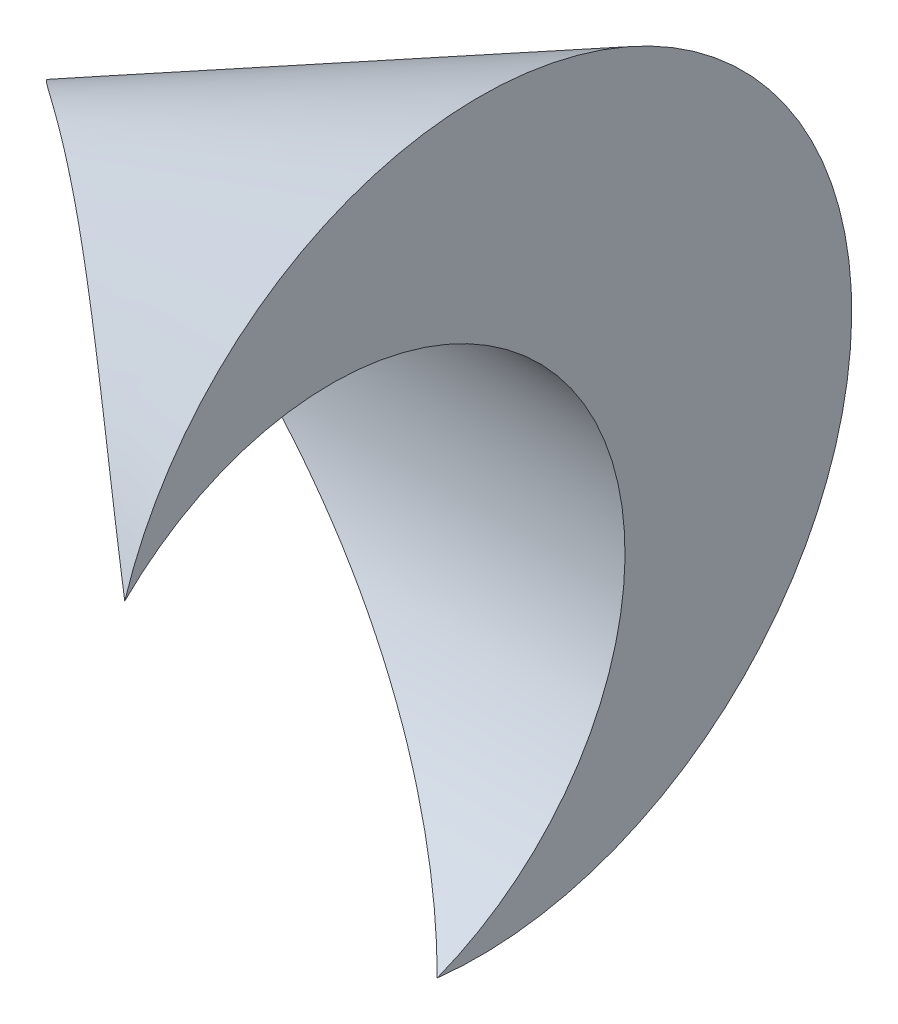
ISO-10303-21;
HEADER;
FILE_DESCRIPTION(('STEP AP214'),'2;1');
FILE_NAME('part.step','',(''),(''),'','','');
FILE_SCHEMA(('AUTOMOTIVE_DESIGN { 1 0 10303 214 1 1 1 1 }'));
ENDSEC;
DATA;
#1=APPLICATION_CONTEXT('core data for automotive mechanical design processes');
#2=APPLICATION_PROTOCOL_DEFINITION('international standard','automotive_design',2000,#1);
#3=PRODUCT_CONTEXT('',#1,'mechanical');
#4=PRODUCT('Part','Part','',(#3));
#5=PRODUCT_RELATED_PRODUCT_CATEGORY('part','',(#4));
#6=PRODUCT_DEFINITION_FORMATION('','',#4);
#7=PRODUCT_DEFINITION_CONTEXT('part definition',#1,'design');
#8=PRODUCT_DEFINITION('design','',#6,#7);
#9=PRODUCT_DEFINITION_SHAPE('','',#8);
#10=(LENGTH_UNIT() NAMED_UNIT(*) SI_UNIT(.MILLI.,.METRE.));
#11=(NAMED_UNIT(*) PLANE_ANGLE_UNIT() SI_UNIT($,.RADIAN.));
#12=(NAMED_UNIT(*) SI_UNIT($,.STERADIAN.) SOLID_ANGLE_UNIT());
#13=UNCERTAINTY_MEASURE_WITH_UNIT(LENGTH_MEASURE(1.E-05),#10,'distance_accuracy_value','');
#14=(GEOMETRIC_REPRESENTATION_CONTEXT(3) GLOBAL_UNCERTAINTY_ASSIGNED_CONTEXT((#13)) GLOBAL_UNIT_ASSIGNED_CONTEXT((#10,
#11,#12)) REPRESENTATION_CONTEXT('',''));
#15=CARTESIAN_POINT('',(0.,0.,0.));
#16=DIRECTION('',(0.,0.,1.));
#17=DIRECTION('',(1.,0.,0.));
#18=AXIS2_PLACEMENT_3D('',#15,#16,#17);
#19=CARTESIAN_POINT('',(2.0014705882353,0.,0.));
#20=DIRECTION('',(1.,0.,0.));
#21=DIRECTION('',(0.,0.,-1.));
#22=AXIS2_PLACEMENT_3D('',#19,#20,#21);
#23=CONICAL_SURFACE('',#22,25.,0.463647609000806);
#24=CARTESIAN_POINT('',(2.0014705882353,0.,0.));
#25=DIRECTION('',(-1.,0.,0.));
#26=DIRECTION('',(0.,0.,1.));
#27=AXIS2_PLACEMENT_3D('',#24,#25,#26);
#28=CIRCLE('',#27,25.);
#29=CARTESIAN_POINT('',(2.0014705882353,7.57732729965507,23.8240238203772));
#30=VERTEX_POINT('',#29);
#31=CARTESIAN_POINT('',(2.0014705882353,-24.8381539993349,2.84008906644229));
#32=VERTEX_POINT('',#31);
#33=EDGE_CURVE('E39',#30,#32,#28,.T.);
#34=ORIENTED_EDGE('',*,*,#33,.T.);
#35=CARTESIAN_POINT('',(2.0016705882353,-24.8382316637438,2.84029009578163));
#36=CARTESIAN_POINT('',(1.64120832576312,-24.6982485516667,2.47796691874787));
#37=CARTESIAN_POINT('',(1.27748238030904,-24.5486908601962,2.12265803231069));
#38=CARTESIAN_POINT('',(0.544145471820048,-24.2317078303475,1.42650655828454));
#39=CARTESIAN_POINT('',(0.174535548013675,-24.0642856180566,1.08566145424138));
#40=CARTESIAN_POINT('',(-0.569659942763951,-23.7129909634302,0.419100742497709));
#41=CARTESIAN_POINT('',(-0.944239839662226,-23.5291360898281,0.0933695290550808));
#42=CARTESIAN_POINT('',(-1.69823194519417,-23.1459912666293,-0.543054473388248));
#43=CARTESIAN_POINT('',(-2.07764437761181,-22.9467006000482,-0.853746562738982));
#44=CARTESIAN_POINT('',(-3.21843626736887,-22.3294816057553,-1.7597317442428));
#45=CARTESIAN_POINT('',(-3.98638408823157,-21.8902918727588,-2.33252399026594));
#46=CARTESIAN_POINT('',(-5.53629157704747,-20.9630068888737,-3.41634728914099));
#47=CARTESIAN_POINT('',(-6.31825536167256,-20.4748970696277,-3.92735984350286));
#48=CARTESIAN_POINT('',(-7.91882682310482,-19.4401387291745,-4.90234660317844));
#49=CARTESIAN_POINT('',(-8.73779865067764,-18.8921017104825,-5.36424764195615));
#50=CARTESIAN_POINT('',(-10.3844298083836,-17.7579424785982,-6.22061950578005));
#51=CARTESIAN_POINT('',(-11.2120888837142,-17.1718213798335,-6.61509230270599));
#52=CARTESIAN_POINT('',(-12.8746430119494,-15.9660468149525,-7.33680621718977));
#53=CARTESIAN_POINT('',(-13.7095480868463,-15.3463372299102,-7.66393014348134));
#54=CARTESIAN_POINT('',(-15.3821275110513,-14.0788858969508,-8.24954905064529));
#55=CARTESIAN_POINT('',(-16.2198016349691,-13.4311463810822,-8.50804948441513));
#56=CARTESIAN_POINT('',(-17.479232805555,-12.4382051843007,-8.84459047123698));
#57=CARTESIAN_POINT('',(-17.9014179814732,-12.1021232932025,-8.94858311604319));
#58=CARTESIAN_POINT('',(-18.7449841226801,-11.4239576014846,-9.13866739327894));
#59=CARTESIAN_POINT('',(-19.1663651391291,-11.0818741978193,-9.22476020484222));
#60=CARTESIAN_POINT('',(-20.0078667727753,-10.3917190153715,-9.37882034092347));
#61=CARTESIAN_POINT('',(-20.4279867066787,-10.0436445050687,-9.44677915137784));
#62=CARTESIAN_POINT('',(-21.2659641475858,-9.34169375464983,-9.56415308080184));
#63=CARTESIAN_POINT('',(-21.683821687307,-8.98781759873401,-9.61356846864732));
#64=CARTESIAN_POINT('',(-22.5171493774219,-8.27336259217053,-9.69343377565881));
#65=CARTESIAN_POINT('',(-22.9326126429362,-7.9127711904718,-9.72384351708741));
#66=CARTESIAN_POINT('',(-23.7589823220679,-7.185209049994,-9.76482458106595));
#67=CARTESIAN_POINT('',(-24.1698884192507,-6.81823787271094,-9.7753945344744));
#68=CARTESIAN_POINT('',(-24.9849695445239,-6.07761079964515,-9.77569322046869));
#69=CARTESIAN_POINT('',(-25.3891504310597,-5.70396138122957,-9.76544116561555));
#70=CARTESIAN_POINT('',(-26.1886964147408,-4.94862837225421,-9.72273293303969));
#71=CARTESIAN_POINT('',(-26.5840632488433,-4.56694639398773,-9.69028117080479));
#72=CARTESIAN_POINT('',(-27.168515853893,-3.98649279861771,-9.62334266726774));
#73=CARTESIAN_POINT('',(-27.362246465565,-3.79132263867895,-9.59792311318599));
#74=CARTESIAN_POINT('',(-27.7459618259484,-3.3982750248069,-9.5406298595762));
#75=CARTESIAN_POINT('',(-27.9359468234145,-3.20039775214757,-9.50875659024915));
#76=CARTESIAN_POINT('',(-28.3115909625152,-2.80144324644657,-9.43811677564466));
#77=CARTESIAN_POINT('',(-28.4972461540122,-2.60036335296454,-9.39934419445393));
#78=CARTESIAN_POINT('',(-28.8630990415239,-2.19481122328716,-9.31442642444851));
#79=CARTESIAN_POINT('',(-29.0432968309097,-1.99033904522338,-9.268281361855));
#80=CARTESIAN_POINT('',(-29.3957474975,-1.5790760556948,-9.16837752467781));
#81=CARTESIAN_POINT('',(-29.5680482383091,-1.37231253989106,-9.11467596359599));
#82=CARTESIAN_POINT('',(-29.904570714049,-0.954571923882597,-8.99869715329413));
#83=CARTESIAN_POINT('',(-30.0687913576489,-0.743594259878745,-8.93641874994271));
#84=CARTESIAN_POINT('',(-30.3868736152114,-0.317403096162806,-8.80257654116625));
#85=CARTESIAN_POINT('',(-30.5407530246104,-0.102197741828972,-8.73102934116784));
#86=CARTESIAN_POINT('',(-30.8358895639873,0.333086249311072,-8.57763887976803));
#87=CARTESIAN_POINT('',(-30.9771522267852,0.553162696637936,-8.49580016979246));
#88=CARTESIAN_POINT('',(-31.2127258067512,0.946382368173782,-8.34123112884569));
#89=CARTESIAN_POINT('',(-31.3102980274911,1.11848552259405,-8.27083597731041));
#90=CARTESIAN_POINT('',(-31.4943994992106,1.46556363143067,-8.12294034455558));
#91=CARTESIAN_POINT('',(-31.5809291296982,1.64053848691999,-8.04544010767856));
#92=CARTESIAN_POINT('',(-31.7408784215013,1.99285901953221,-7.8830386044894));
#93=CARTESIAN_POINT('',(-31.8143096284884,2.17020245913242,-7.79814395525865));
#94=CARTESIAN_POINT('',(-31.9459940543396,2.52668137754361,-7.62072039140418));
#95=CARTESIAN_POINT('',(-32.0042517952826,2.70581630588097,-7.52819376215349));
#96=CARTESIAN_POINT('',(-32.1042458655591,3.0674606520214,-7.3341534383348));
#97=CARTESIAN_POINT('',(-32.1457293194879,3.24998122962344,-7.23252851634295));
#98=CARTESIAN_POINT('',(-32.2091226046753,3.61421789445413,-7.02194743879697));
#99=CARTESIAN_POINT('',(-32.2310340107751,3.79593404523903,-6.91299187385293));
#100=CARTESIAN_POINT('',(-32.2542077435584,4.15658762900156,-6.68870113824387));
#101=CARTESIAN_POINT('',(-32.2554827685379,4.33552670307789,-6.57336993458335));
#102=CARTESIAN_POINT('',(-32.2373464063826,4.68883587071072,-6.33747827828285));
#103=CARTESIAN_POINT('',(-32.2179360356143,4.86320618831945,-6.21691808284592));
#104=CARTESIAN_POINT('',(-32.1639530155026,5.1791349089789,-5.99095524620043));
#105=CARTESIAN_POINT('',(-32.1322021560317,5.32158458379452,-5.88610521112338));
#106=CARTESIAN_POINT('',(-32.0556601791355,5.6013906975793,-5.6743816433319));
#107=CARTESIAN_POINT('',(-32.0108675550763,5.73874654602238,-5.56750787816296));
#108=CARTESIAN_POINT('',(-31.9094699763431,6.00798735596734,-5.35234811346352));
#109=CARTESIAN_POINT('',(-31.8528580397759,6.13986902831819,-5.24406131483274));
#110=CARTESIAN_POINT('',(-31.7291851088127,6.39790421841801,-5.0266520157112));
#111=CARTESIAN_POINT('',(-31.6621226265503,6.52405691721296,-4.91752939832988));
#112=CARTESIAN_POINT('',(-31.462991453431,6.86683524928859,-4.61352289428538));
#113=CARTESIAN_POINT('',(-31.3210160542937,7.07728566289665,-4.4181297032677));
#114=CARTESIAN_POINT('',(-31.014760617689,7.48112552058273,-4.02717331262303));
#115=CARTESIAN_POINT('',(-30.8504630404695,7.67450134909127,-3.8316101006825));
#116=CARTESIAN_POINT('',(-30.5042457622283,8.04629518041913,-3.44023016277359));
#117=CARTESIAN_POINT('',(-30.322268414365,8.22466045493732,-3.2444148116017));
#118=CARTESIAN_POINT('',(-29.9451692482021,8.56727116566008,-2.85332981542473));
#119=CARTESIAN_POINT('',(-29.7500502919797,8.7315196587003,-2.6580600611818));
#120=CARTESIAN_POINT('',(-29.3290244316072,9.06361015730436,-2.24788545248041));
#121=CARTESIAN_POINT('',(-29.1020123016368,9.23009300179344,-2.03302081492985));
#122=CARTESIAN_POINT('',(-28.6383729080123,9.54940022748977,-1.60344767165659));
#123=CARTESIAN_POINT('',(-28.4017432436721,9.70222116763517,-1.38873921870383));
#124=CARTESIAN_POINT('',(-27.920797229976,9.99561417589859,-0.959054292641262));
#125=CARTESIAN_POINT('',(-27.6764738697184,10.1361746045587,-0.744077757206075));
#126=CARTESIAN_POINT('',(-27.1819464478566,10.4059218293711,-0.313829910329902));
#127=CARTESIAN_POINT('',(-26.9317428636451,10.5351095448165,-0.0985586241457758));
#128=CARTESIAN_POINT('',(-26.4261698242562,10.7831756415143,0.332893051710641));
#129=CARTESIAN_POINT('',(-26.1707918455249,10.9020349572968,0.549074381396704));
#130=CARTESIAN_POINT('',(-25.6562331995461,11.1298374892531,0.982123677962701));
#131=CARTESIAN_POINT('',(-25.3970525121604,11.2387806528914,1.19899164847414));
#132=CARTESIAN_POINT('',(-24.8757189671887,11.4472254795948,1.63345236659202));
#133=CARTESIAN_POINT('',(-24.613567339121,11.5467308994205,1.85104478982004));
#134=CARTESIAN_POINT('',(-24.0867618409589,11.736753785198,2.28713109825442));
#135=CARTESIAN_POINT('',(-23.8221078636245,11.8272708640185,2.50562502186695));
#136=CARTESIAN_POINT('',(-23.0677564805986,12.0719943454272,3.12740144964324));
#137=CARTESIAN_POINT('',(-22.5756346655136,12.2158823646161,3.53184312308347));
#138=CARTESIAN_POINT('',(-21.5867906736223,12.4757493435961,4.34410956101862));
#139=CARTESIAN_POINT('',(-21.0900679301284,12.5917248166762,4.75193474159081));
#140=CARTESIAN_POINT('',(-20.0933878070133,12.7966384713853,5.57103868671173));
#141=CARTESIAN_POINT('',(-19.5934286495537,12.8855602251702,5.98231939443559));
#142=CARTESIAN_POINT('',(-18.5918693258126,13.0367225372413,6.80772280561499));
#143=CARTESIAN_POINT('',(-18.0902692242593,13.098964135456,7.22184539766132));
#144=CARTESIAN_POINT('',(-17.0859115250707,13.1970064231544,8.05286359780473));
#145=CARTESIAN_POINT('',(-16.5831532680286,13.2327799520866,8.46976161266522));
#146=CARTESIAN_POINT('',(-15.5778525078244,13.2777713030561,9.30525144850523));
#147=CARTESIAN_POINT('',(-15.0753100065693,13.2869888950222,9.72384328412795));
#148=CARTESIAN_POINT('',(-14.0713541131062,13.2787117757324,10.5618010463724));
#149=CARTESIAN_POINT('',(-13.5699404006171,13.2612259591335,10.9811666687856));
#150=CARTESIAN_POINT('',(-12.568759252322,13.1992957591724,11.8198942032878));
#151=CARTESIAN_POINT('',(-12.0689919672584,13.1548489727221,12.2392561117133));
#152=CARTESIAN_POINT('',(-10.559640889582,12.9789707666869,13.5071667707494));
#153=CARTESIAN_POINT('',(-9.55343606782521,12.8050841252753,14.3543098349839));
#154=CARTESIAN_POINT('',(-7.55549383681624,12.3414424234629,16.0346095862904));
#155=CARTESIAN_POINT('',(-6.56376170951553,12.0516461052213,16.8677611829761));
#156=CARTESIAN_POINT('',(-4.60482793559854,11.3536087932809,18.5039980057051));
#157=CARTESIAN_POINT('',(-3.63753935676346,10.9458808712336,19.3071968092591));
#158=CARTESIAN_POINT('',(-1.730204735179,10.0077193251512,20.8719621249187));
#159=CARTESIAN_POINT('',(-0.790129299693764,9.47742410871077,21.6335744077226));
#160=CARTESIAN_POINT('',(0.448269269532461,8.6812861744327,22.616086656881));
#161=CARTESIAN_POINT('',(0.762090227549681,8.47085507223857,22.863213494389));
#162=CARTESIAN_POINT('',(1.38527115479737,8.03517515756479,23.3496934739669));
#163=CARTESIAN_POINT('',(1.69463223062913,7.80993010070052,23.5890485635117));
#164=CARTESIAN_POINT('',(2.00167058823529,7.57717568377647,23.8241769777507));
#165=B_SPLINE_CURVE_WITH_KNOTS('',3,(#35,#36,#37,#38,#39,#40,#41,#42,#43,#44,#45,#46,#47,#48,
#49,#50,#51,#52,#53,#54,#55,#56,#57,#58,#59,#60,#61,#62,#63,#64,#65,#66,#67,#68,#69,#70,#71,#72,
#73,#74,#75,#76,#77,#78,#79,#80,#81,#82,#83,#84,#85,#86,#87,#88,#89,#90,#91,#92,#93,#94,#95,#96,
#97,#98,#99,#100,#101,#102,#103,#104,#105,#106,#107,#108,#109,#110,#111,#112,#113,#114,#115,
#116,#117,#118,#119,#120,#121,#122,#123,#124,#125,#126,#127,#128,#129,#130,#131,#132,#133,#134,
#135,#136,#137,#138,#139,#140,#141,#142,#143,#144,#145,#146,#147,#148,#149,#150,#151,#152,#153,
#154,#155,#156,#157,#158,#159,#160,#161,#162,#163,#164),.UNSPECIFIED.,.F.,.F.,(4,2,2,2,2,2,2,2,
2,2,2,2,2,2,2,2,2,2,2,2,2,2,2,2,2,2,2,2,2,2,2,2,2,2,2,2,2,2,2,2,2,2,2,2,2,2,2,2,2,2,2,2,2,2,2,2,
2,2,2,2,2,2,2,2,4),(0.,1.58952239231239,3.17876709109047,4.76633254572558,6.3539717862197,
9.51215560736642,12.6712827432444,15.9332650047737,19.1951518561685,22.4626674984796,
25.7299234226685,27.3783106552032,29.0265892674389,30.6756404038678,32.3246676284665,
33.9771691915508,35.6297847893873,37.2808762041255,38.9316393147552,39.7600533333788,
40.5884121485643,41.4174992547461,42.2465721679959,43.0696754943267,43.892889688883,
44.7146489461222,45.5360460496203,46.1656481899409,46.7952286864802,47.4242514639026,
48.0530865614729,48.6910765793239,49.329015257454,49.9665613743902,50.604076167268,
51.1426165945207,51.6812192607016,52.2201409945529,52.7591395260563,53.7185204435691,
54.6786596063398,55.6420417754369,56.6052148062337,57.6671726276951,58.7293971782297,
59.792619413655,60.8557556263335,61.920814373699,62.9858787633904,64.0505174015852,
65.115201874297,67.0736013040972,69.0322452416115,70.992076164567,72.9518306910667,
74.9135934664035,76.8753732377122,78.8364997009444,80.7978009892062,84.7727567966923,
88.7491287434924,92.7084548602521,96.6633316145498,98.0175188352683,99.3713640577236),.UNSPECIFIED.);
#166=EDGE_CURVE('E45',#32,#30,#165,.T.);
#167=ORIENTED_EDGE('',*,*,#166,.T.);
#168=EDGE_LOOP('',(#34,#167));
#169=FACE_BOUND('',#168,.T.);
#170=ADVANCED_FACE('F31',(#169),#23,.T.);
#171=CARTESIAN_POINT('',(2.0014705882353,25.,0.));
#172=DIRECTION('',(-1.,0.,0.));
#173=DIRECTION('',(0.,0.,1.));
#174=AXIS2_PLACEMENT_3D('',#171,#172,#173);
#175=PLANE('',#174);
#176=ORIENTED_EDGE('',*,*,#33,.F.);
#177=CARTESIAN_POINT('',(2.0014705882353,-6.43983083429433,9.94809688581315));
#178=DIRECTION('',(-1.,0.,0.));
#179=DIRECTION('',(0.,0.,1.));
#180=AXIS2_PLACEMENT_3D('',#177,#178,#179);
#181=CIRCLE('',#180,19.7236424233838);
#182=EDGE_CURVE('E11',#30,#32,#181,.T.);
#183=ORIENTED_EDGE('',*,*,#182,.T.);
#184=EDGE_LOOP('',(#176,#183));
#185=FACE_BOUND('',#184,.T.);
#186=ADVANCED_FACE('F52',(#185),#175,.F.);
#187=CARTESIAN_POINT('',(-47.9985294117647,-6.43983083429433,9.94809688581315));
#188=DIRECTION('',(1.,0.,0.));
#189=DIRECTION('',(0.,0.,-1.));
#190=AXIS2_PLACEMENT_3D('',#187,#188,#189);
#191=CYLINDRICAL_SURFACE('',#190,19.7236424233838);
#192=ORIENTED_EDGE('',*,*,#182,.F.);
#193=ORIENTED_EDGE('',*,*,#166,.F.);
#194=EDGE_LOOP('',(#192,#193));
#195=FACE_BOUND('',#194,.T.);
#196=ADVANCED_FACE('F46',(#195),#191,.F.);
#197=CLOSED_SHELL('',(#170,#186,#196));
#198=MANIFOLD_SOLID_BREP('B2',#197);
#199=ADVANCED_BREP_SHAPE_REPRESENTATION('',(#18,#198),#14);
#200=SHAPE_DEFINITION_REPRESENTATION(#9,#199);
ENDSEC;
END-ISO-10303-21;
